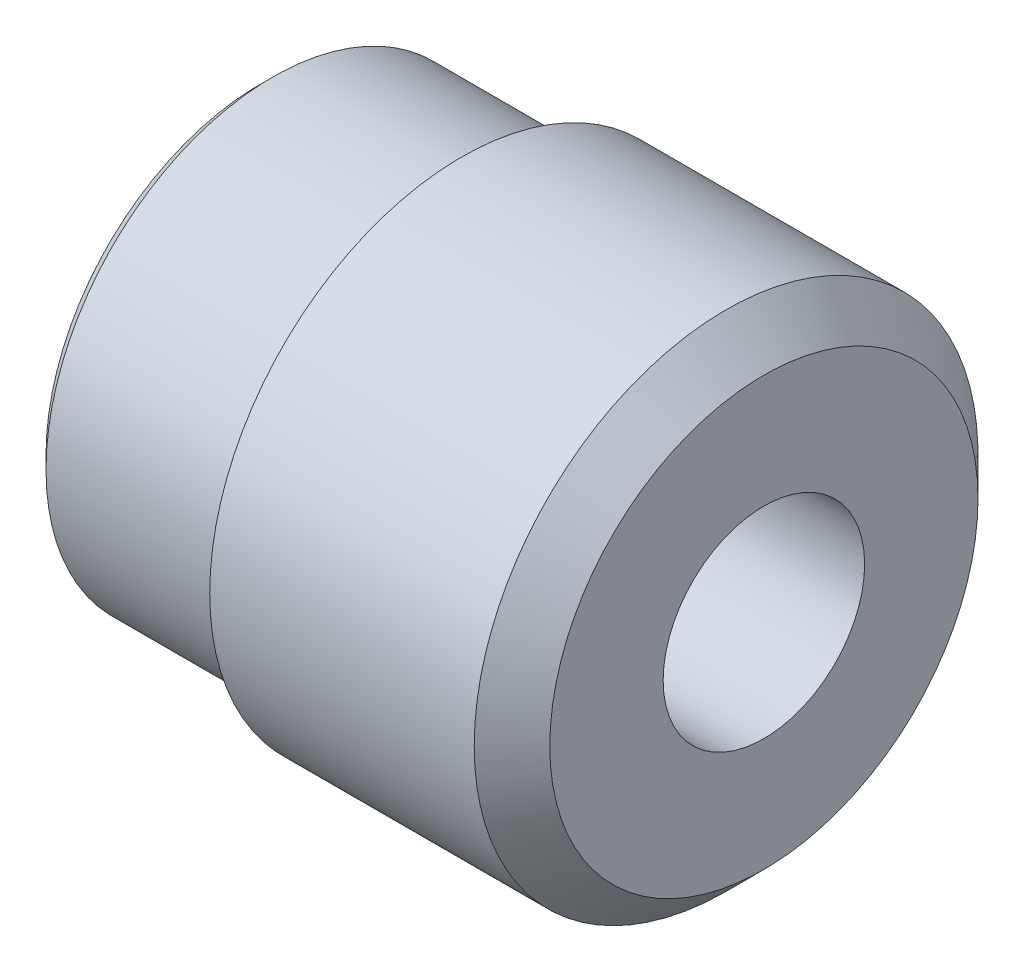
ISO-10303-21;
HEADER;
FILE_DESCRIPTION(('STEP AP214'),'2;1');
FILE_NAME('part.step','',(''),(''),'','','');
FILE_SCHEMA(('AUTOMOTIVE_DESIGN { 1 0 10303 214 1 1 1 1 }'));
ENDSEC;
DATA;
#1=APPLICATION_CONTEXT('core data for automotive mechanical design processes');
#2=APPLICATION_PROTOCOL_DEFINITION('international standard','automotive_design',2000,#1);
#3=PRODUCT_CONTEXT('',#1,'mechanical');
#4=PRODUCT('Part','Part','',(#3));
#5=PRODUCT_RELATED_PRODUCT_CATEGORY('part','',(#4));
#6=PRODUCT_DEFINITION_FORMATION('','',#4);
#7=PRODUCT_DEFINITION_CONTEXT('part definition',#1,'design');
#8=PRODUCT_DEFINITION('design','',#6,#7);
#9=PRODUCT_DEFINITION_SHAPE('','',#8);
#10=(LENGTH_UNIT() NAMED_UNIT(*) SI_UNIT(.MILLI.,.METRE.));
#11=(NAMED_UNIT(*) PLANE_ANGLE_UNIT() SI_UNIT($,.RADIAN.));
#12=(NAMED_UNIT(*) SI_UNIT($,.STERADIAN.) SOLID_ANGLE_UNIT());
#13=UNCERTAINTY_MEASURE_WITH_UNIT(LENGTH_MEASURE(1.E-05),#10,'distance_accuracy_value','');
#14=(GEOMETRIC_REPRESENTATION_CONTEXT(3) GLOBAL_UNCERTAINTY_ASSIGNED_CONTEXT((#13)) GLOBAL_UNIT_ASSIGNED_CONTEXT((#10,
#11,#12)) REPRESENTATION_CONTEXT('',''));
#15=CARTESIAN_POINT('',(0.,0.,0.));
#16=DIRECTION('',(0.,0.,1.));
#17=DIRECTION('',(1.,0.,0.));
#18=AXIS2_PLACEMENT_3D('',#15,#16,#17);
#19=CARTESIAN_POINT('',(0.,6.,0.));
#20=DIRECTION('',(1.,0.,0.));
#21=DIRECTION('',(0.,0.,-1.));
#22=AXIS2_PLACEMENT_3D('',#19,#20,#21);
#23=PLANE('',#22);
#24=CARTESIAN_POINT('',(0.,0.,0.));
#25=DIRECTION('',(-1.,0.,0.));
#26=DIRECTION('',(0.,0.,1.));
#27=AXIS2_PLACEMENT_3D('',#24,#25,#26);
#28=CIRCLE('',#27,4.);
#29=CARTESIAN_POINT('',(0.,0.,4.));
#30=VERTEX_POINT('',#29);
#31=EDGE_CURVE('E45',#30,#30,#28,.T.);
#32=ORIENTED_EDGE('',*,*,#31,.F.);
#33=EDGE_LOOP('',(#32));
#34=FACE_BOUND('',#33,.T.);
#35=CARTESIAN_POINT('',(0.,0.,0.));
#36=DIRECTION('',(-1.,0.,0.));
#37=DIRECTION('',(0.,0.,1.));
#38=AXIS2_PLACEMENT_3D('',#35,#36,#37);
#39=CIRCLE('',#38,6.);
#40=CARTESIAN_POINT('',(0.,0.,6.));
#41=VERTEX_POINT('',#40);
#42=EDGE_CURVE('E60',#41,#41,#39,.T.);
#43=ORIENTED_EDGE('',*,*,#42,.T.);
#44=EDGE_LOOP('',(#43));
#45=FACE_BOUND('',#44,.T.);
#46=ADVANCED_FACE('F26',(#34,#45),#23,.F.);
#47=CARTESIAN_POINT('',(-32.2384615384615,0.,0.));
#48=DIRECTION('',(-1.,0.,0.));
#49=DIRECTION('',(0.,0.,1.));
#50=AXIS2_PLACEMENT_3D('',#47,#48,#49);
#51=CYLINDRICAL_SURFACE('',#50,4.);
#52=CARTESIAN_POINT('',(6.,0.,0.));
#53=DIRECTION('',(-1.,0.,0.));
#54=DIRECTION('',(0.,0.,1.));
#55=AXIS2_PLACEMENT_3D('',#52,#53,#54);
#56=CIRCLE('',#55,4.);
#57=CARTESIAN_POINT('',(6.,0.,4.));
#58=VERTEX_POINT('',#57);
#59=EDGE_CURVE('E48',#58,#58,#56,.T.);
#60=ORIENTED_EDGE('',*,*,#59,.F.);
#61=EDGE_LOOP('',(#60));
#62=FACE_BOUND('',#61,.T.);
#63=ORIENTED_EDGE('',*,*,#31,.T.);
#64=EDGE_LOOP('',(#63));
#65=FACE_BOUND('',#64,.T.);
#66=ADVANCED_FACE('F82',(#62,#65),#51,.F.);
#67=CARTESIAN_POINT('',(6.,10.,0.));
#68=DIRECTION('',(-1.,0.,0.));
#69=DIRECTION('',(0.,0.,1.));
#70=AXIS2_PLACEMENT_3D('',#67,#68,#69);
#71=PLANE('',#70);
#72=CARTESIAN_POINT('',(6.,0.,0.));
#73=DIRECTION('',(-1.,0.,0.));
#74=DIRECTION('',(0.,0.,1.));
#75=AXIS2_PLACEMENT_3D('',#72,#73,#74);
#76=CIRCLE('',#75,8.49999999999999);
#77=CARTESIAN_POINT('',(6.,0.,8.49999999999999));
#78=VERTEX_POINT('',#77);
#79=EDGE_CURVE('E36',#78,#78,#76,.F.);
#80=ORIENTED_EDGE('',*,*,#79,.T.);
#81=EDGE_LOOP('',(#80));
#82=FACE_BOUND('',#81,.T.);
#83=ORIENTED_EDGE('',*,*,#59,.T.);
#84=EDGE_LOOP('',(#83));
#85=FACE_BOUND('',#84,.T.);
#86=ADVANCED_FACE('F87',(#82,#85),#71,.F.);
#87=CARTESIAN_POINT('',(-32.2384615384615,0.,0.));
#88=DIRECTION('',(-1.,0.,0.));
#89=DIRECTION('',(0.,0.,1.));
#90=AXIS2_PLACEMENT_3D('',#87,#88,#89);
#91=CYLINDRICAL_SURFACE('',#90,10.);
#92=CARTESIAN_POINT('',(4.5,0.,0.));
#93=DIRECTION('',(-1.,0.,0.));
#94=DIRECTION('',(0.,0.,1.));
#95=AXIS2_PLACEMENT_3D('',#92,#93,#94);
#96=CIRCLE('',#95,10.);
#97=CARTESIAN_POINT('',(4.5,0.,10.));
#98=VERTEX_POINT('',#97);
#99=EDGE_CURVE('E40',#98,#98,#96,.T.);
#100=ORIENTED_EDGE('',*,*,#99,.T.);
#101=EDGE_LOOP('',(#100));
#102=FACE_BOUND('',#101,.T.);
#103=CARTESIAN_POINT('',(-6.,0.,0.));
#104=DIRECTION('',(-1.,0.,0.));
#105=DIRECTION('',(0.,0.,1.));
#106=AXIS2_PLACEMENT_3D('',#103,#104,#105);
#107=CIRCLE('',#106,10.);
#108=CARTESIAN_POINT('',(-6.,0.,10.));
#109=VERTEX_POINT('',#108);
#110=EDGE_CURVE('E51',#109,#109,#107,.T.);
#111=ORIENTED_EDGE('',*,*,#110,.F.);
#112=EDGE_LOOP('',(#111));
#113=FACE_BOUND('',#112,.T.);
#114=ADVANCED_FACE('F94',(#102,#113),#91,.T.);
#115=CARTESIAN_POINT('',(-6.,9.,0.));
#116=DIRECTION('',(1.,0.,0.));
#117=DIRECTION('',(0.,0.,-1.));
#118=AXIS2_PLACEMENT_3D('',#115,#116,#117);
#119=PLANE('',#118);
#120=CARTESIAN_POINT('',(-6.,0.,0.));
#121=DIRECTION('',(-1.,0.,0.));
#122=DIRECTION('',(0.,0.,1.));
#123=AXIS2_PLACEMENT_3D('',#120,#121,#122);
#124=CIRCLE('',#123,9.);
#125=CARTESIAN_POINT('',(-6.,0.,9.));
#126=VERTEX_POINT('',#125);
#127=EDGE_CURVE('E54',#126,#126,#124,.T.);
#128=ORIENTED_EDGE('',*,*,#127,.F.);
#129=EDGE_LOOP('',(#128));
#130=FACE_BOUND('',#129,.T.);
#131=ORIENTED_EDGE('',*,*,#110,.T.);
#132=EDGE_LOOP('',(#131));
#133=FACE_BOUND('',#132,.T.);
#134=ADVANCED_FACE('F79',(#130,#133),#119,.F.);
#135=CARTESIAN_POINT('',(-32.2384615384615,0.,0.));
#136=DIRECTION('',(-1.,0.,0.));
#137=DIRECTION('',(0.,0.,1.));
#138=AXIS2_PLACEMENT_3D('',#135,#136,#137);
#139=CYLINDRICAL_SURFACE('',#138,9.);
#140=CARTESIAN_POINT('',(-13.5,0.,0.));
#141=DIRECTION('',(1.,0.,0.));
#142=DIRECTION('',(0.,0.,-1.));
#143=AXIS2_PLACEMENT_3D('',#140,#141,#142);
#144=CIRCLE('',#143,9.);
#145=CARTESIAN_POINT('',(-13.5,0.,-9.));
#146=VERTEX_POINT('',#145);
#147=EDGE_CURVE('E10',#146,#146,#144,.T.);
#148=ORIENTED_EDGE('',*,*,#147,.T.);
#149=EDGE_LOOP('',(#148));
#150=FACE_BOUND('',#149,.T.);
#151=ORIENTED_EDGE('',*,*,#127,.T.);
#152=EDGE_LOOP('',(#151));
#153=FACE_BOUND('',#152,.T.);
#154=ADVANCED_FACE('F74',(#150,#153),#139,.T.);
#155=CARTESIAN_POINT('',(-14.,6.,0.));
#156=DIRECTION('',(1.,0.,0.));
#157=DIRECTION('',(0.,0.,-1.));
#158=AXIS2_PLACEMENT_3D('',#155,#156,#157);
#159=PLANE('',#158);
#160=CARTESIAN_POINT('',(-14.,0.,0.));
#161=DIRECTION('',(1.,0.,0.));
#162=DIRECTION('',(0.,0.,-1.));
#163=AXIS2_PLACEMENT_3D('',#160,#161,#162);
#164=CIRCLE('',#163,8.49999999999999);
#165=CARTESIAN_POINT('',(-14.,0.,-8.49999999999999));
#166=VERTEX_POINT('',#165);
#167=EDGE_CURVE('E32',#166,#166,#164,.F.);
#168=ORIENTED_EDGE('',*,*,#167,.T.);
#169=EDGE_LOOP('',(#168));
#170=FACE_BOUND('',#169,.T.);
#171=CARTESIAN_POINT('',(-14.,0.,0.));
#172=DIRECTION('',(-1.,0.,0.));
#173=DIRECTION('',(0.,0.,1.));
#174=AXIS2_PLACEMENT_3D('',#171,#172,#173);
#175=CIRCLE('',#174,6.);
#176=CARTESIAN_POINT('',(-14.,0.,6.));
#177=VERTEX_POINT('',#176);
#178=EDGE_CURVE('E57',#177,#177,#175,.T.);
#179=ORIENTED_EDGE('',*,*,#178,.F.);
#180=EDGE_LOOP('',(#179));
#181=FACE_BOUND('',#180,.T.);
#182=ADVANCED_FACE('F69',(#170,#181),#159,.F.);
#183=CARTESIAN_POINT('',(-32.2384615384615,0.,0.));
#184=DIRECTION('',(-1.,0.,0.));
#185=DIRECTION('',(0.,0.,1.));
#186=AXIS2_PLACEMENT_3D('',#183,#184,#185);
#187=CYLINDRICAL_SURFACE('',#186,6.);
#188=ORIENTED_EDGE('',*,*,#42,.F.);
#189=EDGE_LOOP('',(#188));
#190=FACE_BOUND('',#189,.T.);
#191=ORIENTED_EDGE('',*,*,#178,.T.);
#192=EDGE_LOOP('',(#191));
#193=FACE_BOUND('',#192,.T.);
#194=ADVANCED_FACE('F65',(#190,#193),#187,.F.);
#195=CARTESIAN_POINT('',(4.5,0.,0.));
#196=DIRECTION('',(-1.,0.,0.));
#197=DIRECTION('',(0.,0.,1.));
#198=AXIS2_PLACEMENT_3D('',#195,#196,#197);
#199=CONICAL_SURFACE('',#198,10.,0.785398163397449);
#200=ORIENTED_EDGE('',*,*,#79,.F.);
#201=EDGE_LOOP('',(#200));
#202=FACE_BOUND('',#201,.T.);
#203=ORIENTED_EDGE('',*,*,#99,.F.);
#204=EDGE_LOOP('',(#203));
#205=FACE_BOUND('',#204,.T.);
#206=ADVANCED_FACE('F68',(#202,#205),#199,.T.);
#207=CARTESIAN_POINT('',(-14.,0.,0.));
#208=DIRECTION('',(1.,0.,0.));
#209=DIRECTION('',(0.,0.,-1.));
#210=AXIS2_PLACEMENT_3D('',#207,#208,#209);
#211=CONICAL_SURFACE('',#210,8.49999999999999,0.785398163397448);
#212=ORIENTED_EDGE('',*,*,#147,.F.);
#213=EDGE_LOOP('',(#212));
#214=FACE_BOUND('',#213,.T.);
#215=ORIENTED_EDGE('',*,*,#167,.F.);
#216=EDGE_LOOP('',(#215));
#217=FACE_BOUND('',#216,.T.);
#218=ADVANCED_FACE('F136',(#214,#217),#211,.T.);
#219=CLOSED_SHELL('',(#46,#66,#86,#114,#134,#154,#182,#194,#206,#218));
#220=MANIFOLD_SOLID_BREP('B2',#219);
#221=ADVANCED_BREP_SHAPE_REPRESENTATION('',(#18,#220),#14);
#222=SHAPE_DEFINITION_REPRESENTATION(#9,#221);
ENDSEC;
END-ISO-10303-21;
